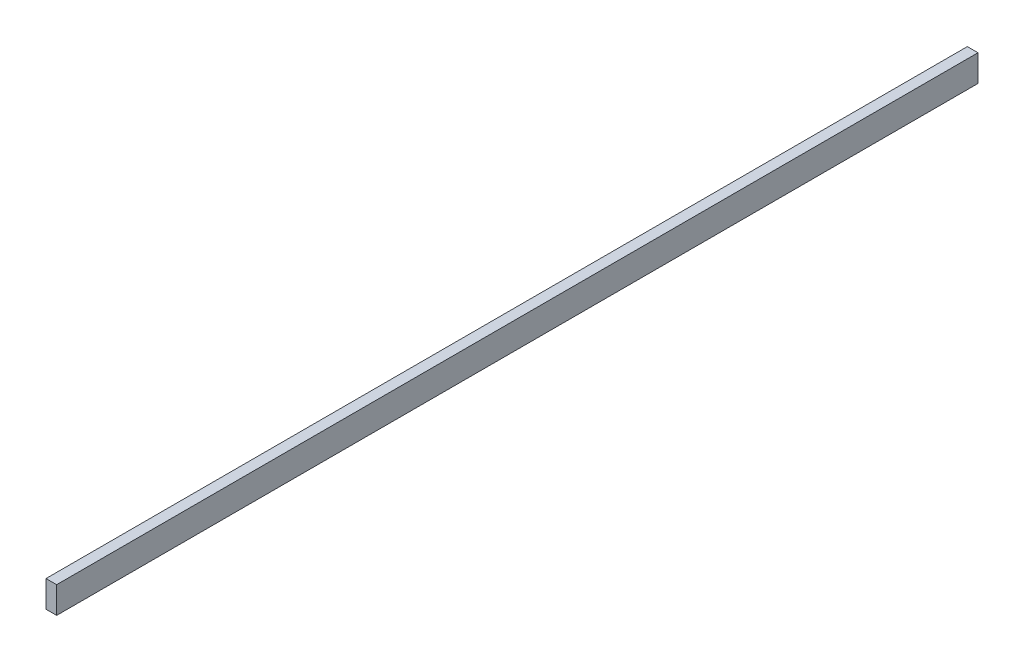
ISO-10303-21;
HEADER;
FILE_DESCRIPTION(('STEP AP214'),'2;1');
FILE_NAME('part.step','',(''),(''),'','','');
FILE_SCHEMA(('AUTOMOTIVE_DESIGN { 1 0 10303 214 1 1 1 1 }'));
ENDSEC;
DATA;
#1=APPLICATION_CONTEXT('core data for automotive mechanical design processes');
#2=APPLICATION_PROTOCOL_DEFINITION('international standard','automotive_design',2000,#1);
#3=PRODUCT_CONTEXT('',#1,'mechanical');
#4=PRODUCT('Part','Part','',(#3));
#5=PRODUCT_RELATED_PRODUCT_CATEGORY('part','',(#4));
#6=PRODUCT_DEFINITION_FORMATION('','',#4);
#7=PRODUCT_DEFINITION_CONTEXT('part definition',#1,'design');
#8=PRODUCT_DEFINITION('design','',#6,#7);
#9=PRODUCT_DEFINITION_SHAPE('','',#8);
#10=(LENGTH_UNIT() NAMED_UNIT(*) SI_UNIT(.MILLI.,.METRE.));
#11=(NAMED_UNIT(*) PLANE_ANGLE_UNIT() SI_UNIT($,.RADIAN.));
#12=(NAMED_UNIT(*) SI_UNIT($,.STERADIAN.) SOLID_ANGLE_UNIT());
#13=UNCERTAINTY_MEASURE_WITH_UNIT(LENGTH_MEASURE(1.E-05),#10,'distance_accuracy_value','');
#14=(GEOMETRIC_REPRESENTATION_CONTEXT(3) GLOBAL_UNCERTAINTY_ASSIGNED_CONTEXT((#13)) GLOBAL_UNIT_ASSIGNED_CONTEXT((#10,
#11,#12)) REPRESENTATION_CONTEXT('',''));
#15=CARTESIAN_POINT('',(0.,0.,0.));
#16=DIRECTION('',(0.,0.,1.));
#17=DIRECTION('',(1.,0.,0.));
#18=AXIS2_PLACEMENT_3D('',#15,#16,#17);
#19=CARTESIAN_POINT('',(8.,0.,0.));
#20=DIRECTION('',(1.,0.,0.));
#21=DIRECTION('',(0.,0.,-1.));
#22=AXIS2_PLACEMENT_3D('',#19,#20,#21);
#23=PLANE('',#22);
#24=DIRECTION('',(0.,1.,0.));
#25=VECTOR('',#24,1.);
#26=CARTESIAN_POINT('',(8.,10.,692.));
#27=LINE('',#26,#25);
#28=CARTESIAN_POINT('',(8.,0.,692.));
#29=VERTEX_POINT('',#28);
#30=CARTESIAN_POINT('',(8.,20.,692.));
#31=VERTEX_POINT('',#30);
#32=EDGE_CURVE('E68',#29,#31,#27,.T.);
#33=ORIENTED_EDGE('',*,*,#32,.F.);
#34=DIRECTION('',(0.,0.,-1.));
#35=VECTOR('',#34,1.);
#36=CARTESIAN_POINT('',(8.,0.,0.));
#37=LINE('',#36,#35);
#38=CARTESIAN_POINT('',(8.,0.,0.));
#39=VERTEX_POINT('',#38);
#40=EDGE_CURVE('E55',#39,#29,#37,.F.);
#41=ORIENTED_EDGE('',*,*,#40,.F.);
#42=DIRECTION('',(0.,1.,0.));
#43=VECTOR('',#42,1.);
#44=CARTESIAN_POINT('',(8.,10.,0.));
#45=LINE('',#44,#43);
#46=CARTESIAN_POINT('',(8.,20.,0.));
#47=VERTEX_POINT('',#46);
#48=EDGE_CURVE('E20',#39,#47,#45,.T.);
#49=ORIENTED_EDGE('',*,*,#48,.T.);
#50=DIRECTION('',(0.,0.,1.));
#51=VECTOR('',#50,1.);
#52=CARTESIAN_POINT('',(8.,20.,0.));
#53=LINE('',#52,#51);
#54=EDGE_CURVE('E81',#31,#47,#53,.F.);
#55=ORIENTED_EDGE('',*,*,#54,.F.);
#56=EDGE_LOOP('',(#33,#41,#49,#55));
#57=FACE_BOUND('',#56,.T.);
#58=ADVANCED_FACE('F17',(#57),#23,.T.);
#59=CARTESIAN_POINT('',(4.,10.,0.));
#60=DIRECTION('',(0.,0.,1.));
#61=DIRECTION('',(1.,0.,0.));
#62=AXIS2_PLACEMENT_3D('',#59,#60,#61);
#63=PLANE('',#62);
#64=DIRECTION('',(0.,1.,0.));
#65=VECTOR('',#64,1.);
#66=CARTESIAN_POINT('',(0.,20.,0.));
#67=LINE('',#66,#65);
#68=CARTESIAN_POINT('',(0.,20.,0.));
#69=VERTEX_POINT('',#68);
#70=CARTESIAN_POINT('',(0.,0.,0.));
#71=VERTEX_POINT('',#70);
#72=EDGE_CURVE('E83',#69,#71,#67,.F.);
#73=ORIENTED_EDGE('',*,*,#72,.F.);
#74=DIRECTION('',(1.,0.,0.));
#75=VECTOR('',#74,1.);
#76=CARTESIAN_POINT('',(8.,20.,0.));
#77=LINE('',#76,#75);
#78=EDGE_CURVE('E64',#47,#69,#77,.F.);
#79=ORIENTED_EDGE('',*,*,#78,.F.);
#80=ORIENTED_EDGE('',*,*,#48,.F.);
#81=DIRECTION('',(1.,0.,0.));
#82=VECTOR('',#81,1.);
#83=CARTESIAN_POINT('',(0.,0.,0.));
#84=LINE('',#83,#82);
#85=EDGE_CURVE('E61',#71,#39,#84,.T.);
#86=ORIENTED_EDGE('',*,*,#85,.F.);
#87=EDGE_LOOP('',(#73,#79,#80,#86));
#88=FACE_BOUND('',#87,.T.);
#89=ADVANCED_FACE('F60',(#88),#63,.F.);
#90=CARTESIAN_POINT('',(0.,0.,0.));
#91=DIRECTION('',(0.,-1.,0.));
#92=DIRECTION('',(0.,0.,-1.));
#93=AXIS2_PLACEMENT_3D('',#90,#91,#92);
#94=PLANE('',#93);
#95=DIRECTION('',(1.,0.,0.));
#96=VECTOR('',#95,1.);
#97=CARTESIAN_POINT('',(4.,0.,692.));
#98=LINE('',#97,#96);
#99=CARTESIAN_POINT('',(0.,0.,692.));
#100=VERTEX_POINT('',#99);
#101=EDGE_CURVE('E70',#100,#29,#98,.T.);
#102=ORIENTED_EDGE('',*,*,#101,.F.);
#103=DIRECTION('',(0.,0.,1.));
#104=VECTOR('',#103,1.);
#105=CARTESIAN_POINT('',(0.,0.,0.));
#106=LINE('',#105,#104);
#107=EDGE_CURVE('E74',#71,#100,#106,.T.);
#108=ORIENTED_EDGE('',*,*,#107,.F.);
#109=ORIENTED_EDGE('',*,*,#85,.T.);
#110=ORIENTED_EDGE('',*,*,#40,.T.);
#111=EDGE_LOOP('',(#102,#108,#109,#110));
#112=FACE_BOUND('',#111,.T.);
#113=ADVANCED_FACE('F72',(#112),#94,.T.);
#114=CARTESIAN_POINT('',(4.,10.,692.));
#115=DIRECTION('',(0.,0.,1.));
#116=DIRECTION('',(1.,0.,0.));
#117=AXIS2_PLACEMENT_3D('',#114,#115,#116);
#118=PLANE('',#117);
#119=DIRECTION('',(1.,0.,0.));
#120=VECTOR('',#119,1.);
#121=CARTESIAN_POINT('',(8.,20.,692.));
#122=LINE('',#121,#120);
#123=CARTESIAN_POINT('',(0.,20.,692.));
#124=VERTEX_POINT('',#123);
#125=EDGE_CURVE('E35',#124,#31,#122,.T.);
#126=ORIENTED_EDGE('',*,*,#125,.F.);
#127=DIRECTION('',(0.,1.,0.));
#128=VECTOR('',#127,1.);
#129=CARTESIAN_POINT('',(0.,20.,692.));
#130=LINE('',#129,#128);
#131=EDGE_CURVE('E26',#100,#124,#130,.T.);
#132=ORIENTED_EDGE('',*,*,#131,.F.);
#133=ORIENTED_EDGE('',*,*,#101,.T.);
#134=ORIENTED_EDGE('',*,*,#32,.T.);
#135=EDGE_LOOP('',(#126,#132,#133,#134));
#136=FACE_BOUND('',#135,.T.);
#137=ADVANCED_FACE('F89',(#136),#118,.T.);
#138=CARTESIAN_POINT('',(8.,20.,0.));
#139=DIRECTION('',(0.,1.,0.));
#140=DIRECTION('',(0.,0.,1.));
#141=AXIS2_PLACEMENT_3D('',#138,#139,#140);
#142=PLANE('',#141);
#143=ORIENTED_EDGE('',*,*,#125,.T.);
#144=ORIENTED_EDGE('',*,*,#54,.T.);
#145=ORIENTED_EDGE('',*,*,#78,.T.);
#146=DIRECTION('',(0.,0.,1.));
#147=VECTOR('',#146,1.);
#148=CARTESIAN_POINT('',(0.,20.,0.));
#149=LINE('',#148,#147);
#150=EDGE_CURVE('E11',#124,#69,#149,.F.);
#151=ORIENTED_EDGE('',*,*,#150,.F.);
#152=EDGE_LOOP('',(#143,#144,#145,#151));
#153=FACE_BOUND('',#152,.T.);
#154=ADVANCED_FACE('F91',(#153),#142,.T.);
#155=CARTESIAN_POINT('',(0.,20.,0.));
#156=DIRECTION('',(-1.,0.,0.));
#157=DIRECTION('',(0.,0.,1.));
#158=AXIS2_PLACEMENT_3D('',#155,#156,#157);
#159=PLANE('',#158);
#160=ORIENTED_EDGE('',*,*,#131,.T.);
#161=ORIENTED_EDGE('',*,*,#150,.T.);
#162=ORIENTED_EDGE('',*,*,#72,.T.);
#163=ORIENTED_EDGE('',*,*,#107,.T.);
#164=EDGE_LOOP('',(#160,#161,#162,#163));
#165=FACE_BOUND('',#164,.T.);
#166=ADVANCED_FACE('F88',(#165),#159,.T.);
#167=CLOSED_SHELL('',(#58,#89,#113,#137,#154,#166));
#168=MANIFOLD_SOLID_BREP('B1',#167);
#169=ADVANCED_BREP_SHAPE_REPRESENTATION('',(#18,#168),#14);
#170=SHAPE_DEFINITION_REPRESENTATION(#9,#169);
ENDSEC;
END-ISO-10303-21;
